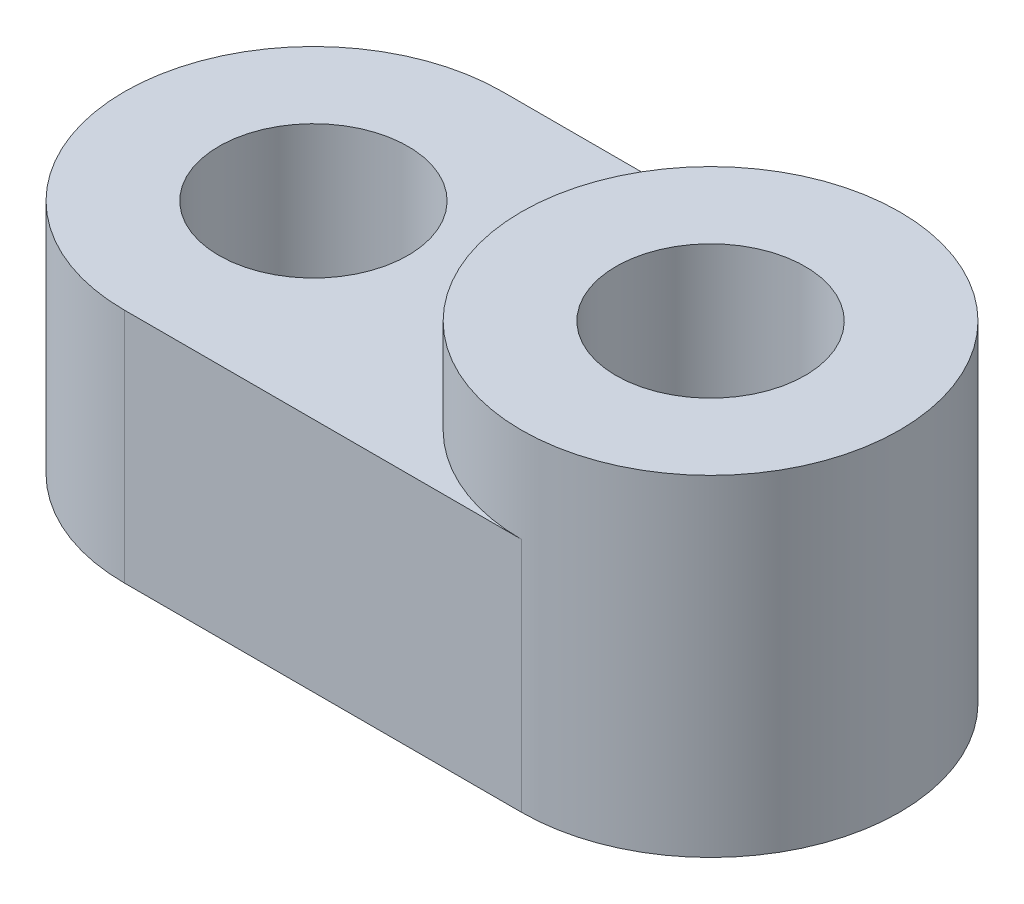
ISO-10303-21;
HEADER;
FILE_DESCRIPTION(('STEP AP214'),'2;1');
FILE_NAME('part.step','',(''),(''),'','','');
FILE_SCHEMA(('AUTOMOTIVE_DESIGN { 1 0 10303 214 1 1 1 1 }'));
ENDSEC;
DATA;
#1=APPLICATION_CONTEXT('core data for automotive mechanical design processes');
#2=APPLICATION_PROTOCOL_DEFINITION('international standard','automotive_design',2000,#1);
#3=PRODUCT_CONTEXT('',#1,'mechanical');
#4=PRODUCT('Part','Part','',(#3));
#5=PRODUCT_RELATED_PRODUCT_CATEGORY('part','',(#4));
#6=PRODUCT_DEFINITION_FORMATION('','',#4);
#7=PRODUCT_DEFINITION_CONTEXT('part definition',#1,'design');
#8=PRODUCT_DEFINITION('design','',#6,#7);
#9=PRODUCT_DEFINITION_SHAPE('','',#8);
#10=(LENGTH_UNIT() NAMED_UNIT(*) SI_UNIT(.MILLI.,.METRE.));
#11=(NAMED_UNIT(*) PLANE_ANGLE_UNIT() SI_UNIT($,.RADIAN.));
#12=(NAMED_UNIT(*) SI_UNIT($,.STERADIAN.) SOLID_ANGLE_UNIT());
#13=UNCERTAINTY_MEASURE_WITH_UNIT(LENGTH_MEASURE(1.E-05),#10,'distance_accuracy_value','');
#14=(GEOMETRIC_REPRESENTATION_CONTEXT(3) GLOBAL_UNCERTAINTY_ASSIGNED_CONTEXT((#13)) GLOBAL_UNIT_ASSIGNED_CONTEXT((#10,
#11,#12)) REPRESENTATION_CONTEXT('',''));
#15=CARTESIAN_POINT('',(0.,0.,0.));
#16=DIRECTION('',(0.,0.,1.));
#17=DIRECTION('',(1.,0.,0.));
#18=AXIS2_PLACEMENT_3D('',#15,#16,#17);
#19=CARTESIAN_POINT('',(0.,5.,0.));
#20=DIRECTION('',(0.,1.,0.));
#21=DIRECTION('',(0.,0.,1.));
#22=AXIS2_PLACEMENT_3D('',#19,#20,#21);
#23=PLANE('',#22);
#24=CARTESIAN_POINT('',(8.4,5.,0.));
#25=DIRECTION('',(0.,1.,0.));
#26=DIRECTION('',(0.,0.,1.));
#27=AXIS2_PLACEMENT_3D('',#24,#25,#26);
#28=CIRCLE('',#27,4.);
#29=CARTESIAN_POINT('',(8.4,5.,-4.));
#30=VERTEX_POINT('',#29);
#31=CARTESIAN_POINT('',(8.4,5.,4.));
#32=VERTEX_POINT('',#31);
#33=EDGE_CURVE('E11',#30,#32,#28,.T.);
#34=ORIENTED_EDGE('',*,*,#33,.F.);
#35=DIRECTION('',(-1.,0.,0.));
#36=VECTOR('',#35,1.);
#37=CARTESIAN_POINT('',(0.,5.,-4.));
#38=LINE('',#37,#36);
#39=CARTESIAN_POINT('',(0.,5.,-4.));
#40=VERTEX_POINT('',#39);
#41=EDGE_CURVE('E50',#30,#40,#38,.T.);
#42=ORIENTED_EDGE('',*,*,#41,.T.);
#43=CARTESIAN_POINT('',(0.,5.,0.));
#44=DIRECTION('',(0.,1.,0.));
#45=DIRECTION('',(0.,0.,1.));
#46=AXIS2_PLACEMENT_3D('',#43,#44,#45);
#47=CIRCLE('',#46,4.);
#48=CARTESIAN_POINT('',(0.,5.,4.));
#49=VERTEX_POINT('',#48);
#50=EDGE_CURVE('E88',#40,#49,#47,.T.);
#51=ORIENTED_EDGE('',*,*,#50,.T.);
#52=DIRECTION('',(1.,0.,0.));
#53=VECTOR('',#52,1.);
#54=CARTESIAN_POINT('',(0.,5.,4.));
#55=LINE('',#54,#53);
#56=EDGE_CURVE('E80',#49,#32,#55,.T.);
#57=ORIENTED_EDGE('',*,*,#56,.T.);
#58=EDGE_LOOP('',(#34,#42,#51,#57));
#59=FACE_BOUND('',#58,.T.);
#60=CARTESIAN_POINT('',(0.,5.,0.));
#61=DIRECTION('',(0.,1.,0.));
#62=DIRECTION('',(0.,0.,1.));
#63=AXIS2_PLACEMENT_3D('',#60,#61,#62);
#64=CIRCLE('',#63,2.);
#65=CARTESIAN_POINT('',(0.,5.,2.));
#66=VERTEX_POINT('',#65);
#67=EDGE_CURVE('E103',#66,#66,#64,.T.);
#68=ORIENTED_EDGE('',*,*,#67,.F.);
#69=EDGE_LOOP('',(#68));
#70=FACE_BOUND('',#69,.T.);
#71=ADVANCED_FACE('F32',(#59,#70),#23,.T.);
#72=CARTESIAN_POINT('',(0.,0.,0.));
#73=DIRECTION('',(0.,1.,0.));
#74=DIRECTION('',(0.,0.,1.));
#75=AXIS2_PLACEMENT_3D('',#72,#73,#74);
#76=PLANE('',#75);
#77=CARTESIAN_POINT('',(0.,0.,0.));
#78=DIRECTION('',(0.,1.,0.));
#79=DIRECTION('',(0.,0.,1.));
#80=AXIS2_PLACEMENT_3D('',#77,#78,#79);
#81=CIRCLE('',#80,4.);
#82=CARTESIAN_POINT('',(0.,0.,-4.));
#83=VERTEX_POINT('',#82);
#84=CARTESIAN_POINT('',(0.,0.,4.));
#85=VERTEX_POINT('',#84);
#86=EDGE_CURVE('E100',#83,#85,#81,.T.);
#87=ORIENTED_EDGE('',*,*,#86,.F.);
#88=DIRECTION('',(-1.,0.,0.));
#89=VECTOR('',#88,1.);
#90=CARTESIAN_POINT('',(0.,0.,-4.));
#91=LINE('',#90,#89);
#92=CARTESIAN_POINT('',(8.4,0.,-4.));
#93=VERTEX_POINT('',#92);
#94=EDGE_CURVE('E73',#93,#83,#91,.T.);
#95=ORIENTED_EDGE('',*,*,#94,.F.);
#96=CARTESIAN_POINT('',(8.4,0.,0.));
#97=DIRECTION('',(0.,1.,0.));
#98=DIRECTION('',(0.,0.,1.));
#99=AXIS2_PLACEMENT_3D('',#96,#97,#98);
#100=CIRCLE('',#99,4.);
#101=CARTESIAN_POINT('',(8.4,0.,4.));
#102=VERTEX_POINT('',#101);
#103=EDGE_CURVE('E68',#102,#93,#100,.T.);
#104=ORIENTED_EDGE('',*,*,#103,.F.);
#105=DIRECTION('',(1.,0.,0.));
#106=VECTOR('',#105,1.);
#107=CARTESIAN_POINT('',(0.,0.,4.));
#108=LINE('',#107,#106);
#109=EDGE_CURVE('E84',#85,#102,#108,.T.);
#110=ORIENTED_EDGE('',*,*,#109,.F.);
#111=EDGE_LOOP('',(#87,#95,#104,#110));
#112=FACE_BOUND('',#111,.T.);
#113=CARTESIAN_POINT('',(0.,0.,0.));
#114=DIRECTION('',(0.,1.,0.));
#115=DIRECTION('',(0.,0.,1.));
#116=AXIS2_PLACEMENT_3D('',#113,#114,#115);
#117=CIRCLE('',#116,2.);
#118=CARTESIAN_POINT('',(0.,0.,2.));
#119=VERTEX_POINT('',#118);
#120=EDGE_CURVE('E107',#119,#119,#117,.T.);
#121=ORIENTED_EDGE('',*,*,#120,.T.);
#122=EDGE_LOOP('',(#121));
#123=FACE_BOUND('',#122,.T.);
#124=CARTESIAN_POINT('',(8.4,0.,0.));
#125=DIRECTION('',(0.,1.,0.));
#126=DIRECTION('',(0.,0.,1.));
#127=AXIS2_PLACEMENT_3D('',#124,#125,#126);
#128=CIRCLE('',#127,2.);
#129=CARTESIAN_POINT('',(8.4,0.,2.));
#130=VERTEX_POINT('',#129);
#131=EDGE_CURVE('E110',#130,#130,#128,.T.);
#132=ORIENTED_EDGE('',*,*,#131,.T.);
#133=EDGE_LOOP('',(#132));
#134=FACE_BOUND('',#133,.T.);
#135=ADVANCED_FACE('F135',(#112,#123,#134),#76,.F.);
#136=CARTESIAN_POINT('',(0.,5.,0.));
#137=DIRECTION('',(0.,-1.,0.));
#138=DIRECTION('',(0.,0.,-1.));
#139=AXIS2_PLACEMENT_3D('',#136,#137,#138);
#140=CYLINDRICAL_SURFACE('',#139,4.);
#141=ORIENTED_EDGE('',*,*,#86,.T.);
#142=DIRECTION('',(0.,-1.,0.));
#143=VECTOR('',#142,1.);
#144=CARTESIAN_POINT('',(0.,5.,4.));
#145=LINE('',#144,#143);
#146=EDGE_CURVE('E36',#49,#85,#145,.T.);
#147=ORIENTED_EDGE('',*,*,#146,.F.);
#148=ORIENTED_EDGE('',*,*,#50,.F.);
#149=DIRECTION('',(0.,-1.,0.));
#150=VECTOR('',#149,1.);
#151=CARTESIAN_POINT('',(0.,5.,-4.));
#152=LINE('',#151,#150);
#153=EDGE_CURVE('E93',#40,#83,#152,.T.);
#154=ORIENTED_EDGE('',*,*,#153,.T.);
#155=EDGE_LOOP('',(#141,#147,#148,#154));
#156=FACE_BOUND('',#155,.T.);
#157=ADVANCED_FACE('F34',(#156),#140,.T.);
#158=CARTESIAN_POINT('',(0.,5.,4.));
#159=DIRECTION('',(0.,0.,-1.));
#160=DIRECTION('',(-1.,0.,0.));
#161=AXIS2_PLACEMENT_3D('',#158,#159,#160);
#162=PLANE('',#161);
#163=ORIENTED_EDGE('',*,*,#109,.T.);
#164=DIRECTION('',(0.,-1.,0.));
#165=VECTOR('',#164,1.);
#166=CARTESIAN_POINT('',(8.4,5.,4.));
#167=LINE('',#166,#165);
#168=EDGE_CURVE('E82',#32,#102,#167,.T.);
#169=ORIENTED_EDGE('',*,*,#168,.F.);
#170=ORIENTED_EDGE('',*,*,#56,.F.);
#171=ORIENTED_EDGE('',*,*,#146,.T.);
#172=EDGE_LOOP('',(#163,#169,#170,#171));
#173=FACE_BOUND('',#172,.T.);
#174=ADVANCED_FACE('F83',(#173),#162,.F.);
#175=CARTESIAN_POINT('',(8.4,5.,0.));
#176=DIRECTION('',(0.,-1.,0.));
#177=DIRECTION('',(0.,0.,-1.));
#178=AXIS2_PLACEMENT_3D('',#175,#176,#177);
#179=CYLINDRICAL_SURFACE('',#178,4.);
#180=ORIENTED_EDGE('',*,*,#103,.T.);
#181=DIRECTION('',(0.,-1.,0.));
#182=VECTOR('',#181,1.);
#183=CARTESIAN_POINT('',(8.4,5.,-4.));
#184=LINE('',#183,#182);
#185=EDGE_CURVE('E85',#30,#93,#184,.T.);
#186=ORIENTED_EDGE('',*,*,#185,.F.);
#187=ORIENTED_EDGE('',*,*,#33,.T.);
#188=ORIENTED_EDGE('',*,*,#168,.T.);
#189=EDGE_LOOP('',(#180,#186,#187,#188));
#190=FACE_BOUND('',#189,.T.);
#191=CARTESIAN_POINT('',(8.4,7.,0.));
#192=DIRECTION('',(0.,1.,0.));
#193=DIRECTION('',(0.,0.,1.));
#194=AXIS2_PLACEMENT_3D('',#191,#192,#193);
#195=CIRCLE('',#194,4.);
#196=CARTESIAN_POINT('',(8.4,7.,4.));
#197=VERTEX_POINT('',#196);
#198=EDGE_CURVE('E114',#197,#197,#195,.T.);
#199=ORIENTED_EDGE('',*,*,#198,.F.);
#200=EDGE_LOOP('',(#199));
#201=FACE_BOUND('',#200,.T.);
#202=ADVANCED_FACE('F91',(#190,#201),#179,.T.);
#203=CARTESIAN_POINT('',(0.,5.,-4.));
#204=DIRECTION('',(0.,0.,1.));
#205=DIRECTION('',(1.,0.,0.));
#206=AXIS2_PLACEMENT_3D('',#203,#204,#205);
#207=PLANE('',#206);
#208=ORIENTED_EDGE('',*,*,#94,.T.);
#209=ORIENTED_EDGE('',*,*,#153,.F.);
#210=ORIENTED_EDGE('',*,*,#41,.F.);
#211=ORIENTED_EDGE('',*,*,#185,.T.);
#212=EDGE_LOOP('',(#208,#209,#210,#211));
#213=FACE_BOUND('',#212,.T.);
#214=ADVANCED_FACE('F95',(#213),#207,.F.);
#215=CARTESIAN_POINT('',(0.,5.,0.));
#216=DIRECTION('',(0.,-1.,0.));
#217=DIRECTION('',(0.,0.,-1.));
#218=AXIS2_PLACEMENT_3D('',#215,#216,#217);
#219=CYLINDRICAL_SURFACE('',#218,2.);
#220=ORIENTED_EDGE('',*,*,#67,.T.);
#221=EDGE_LOOP('',(#220));
#222=FACE_BOUND('',#221,.T.);
#223=ORIENTED_EDGE('',*,*,#120,.F.);
#224=EDGE_LOOP('',(#223));
#225=FACE_BOUND('',#224,.T.);
#226=ADVANCED_FACE('F131',(#222,#225),#219,.F.);
#227=CARTESIAN_POINT('',(8.4,5.,0.));
#228=DIRECTION('',(0.,-1.,0.));
#229=DIRECTION('',(0.,0.,-1.));
#230=AXIS2_PLACEMENT_3D('',#227,#228,#229);
#231=CYLINDRICAL_SURFACE('',#230,2.);
#232=ORIENTED_EDGE('',*,*,#131,.F.);
#233=EDGE_LOOP('',(#232));
#234=FACE_BOUND('',#233,.T.);
#235=CARTESIAN_POINT('',(8.4,7.,0.));
#236=DIRECTION('',(0.,1.,0.));
#237=DIRECTION('',(0.,0.,1.));
#238=AXIS2_PLACEMENT_3D('',#235,#236,#237);
#239=CIRCLE('',#238,2.);
#240=CARTESIAN_POINT('',(8.4,7.,2.));
#241=VERTEX_POINT('',#240);
#242=EDGE_CURVE('E118',#241,#241,#239,.T.);
#243=ORIENTED_EDGE('',*,*,#242,.T.);
#244=EDGE_LOOP('',(#243));
#245=FACE_BOUND('',#244,.T.);
#246=ADVANCED_FACE('F122',(#234,#245),#231,.F.);
#247=CARTESIAN_POINT('',(8.4,7.,0.));
#248=DIRECTION('',(0.,1.,0.));
#249=DIRECTION('',(0.,0.,1.));
#250=AXIS2_PLACEMENT_3D('',#247,#248,#249);
#251=PLANE('',#250);
#252=ORIENTED_EDGE('',*,*,#198,.T.);
#253=EDGE_LOOP('',(#252));
#254=FACE_BOUND('',#253,.T.);
#255=ORIENTED_EDGE('',*,*,#242,.F.);
#256=EDGE_LOOP('',(#255));
#257=FACE_BOUND('',#256,.T.);
#258=ADVANCED_FACE('F124',(#254,#257),#251,.T.);
#259=CLOSED_SHELL('',(#71,#135,#157,#174,#202,#214,#226,#246,#258));
#260=MANIFOLD_SOLID_BREP('B2',#259);
#261=ADVANCED_BREP_SHAPE_REPRESENTATION('',(#18,#260),#14);
#262=SHAPE_DEFINITION_REPRESENTATION(#9,#261);
ENDSEC;
END-ISO-10303-21;
